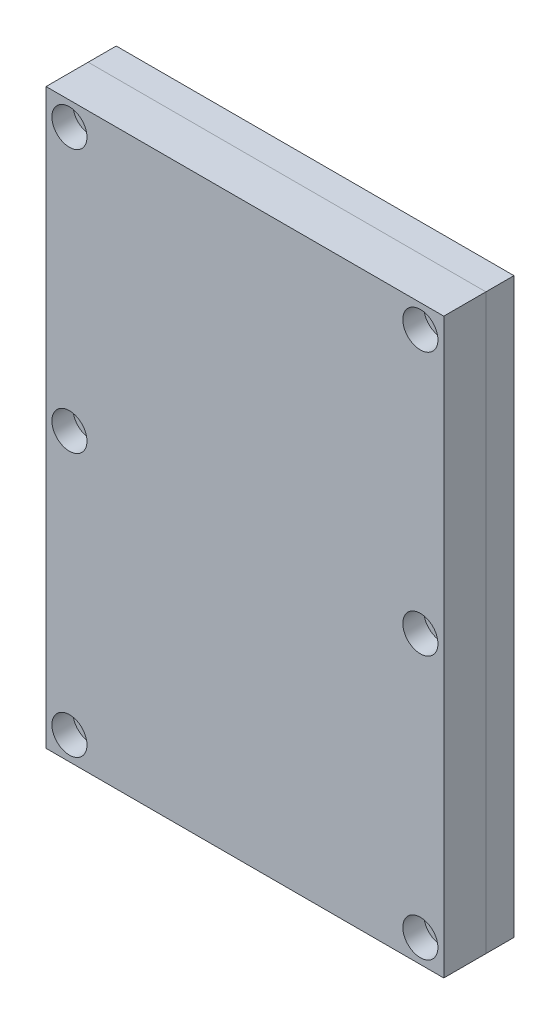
from build123d import *

# Parameters (mm, degrees)
CROQUIS1_W              = 170
CROQUIS1_H              = 245
SALIENTE_EXTRUIR1_DEPTH = 12
CROQUIS2_W              = 170
CROQUIS2_H              = 245
SALIENTE_EXTRUIR2_DEPTH = 18
CROQUIS3_R              = 4.5
CORTAR_EXTRUIR1_DEPTH   = 153.089611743
CROQUIS4_R              = 7.5
CORTAR_EXTRUIR2_DEPTH   = 9


with BuildPart() as part:
    # Croquis1 → Saliente-Extruir1 (new body)
    with BuildSketch(Plane.XY):
        Rectangle(CROQUIS1_W, CROQUIS1_H)
    extrude(amount=SALIENTE_EXTRUIR1_DEPTH)


with BuildPart() as body_2:
    # Croquis2 → Saliente-Extruir2 (new body)
    with BuildSketch(Plane.XY.offset(12)):
        Rectangle(CROQUIS2_W, CROQUIS2_H)
    extrude(amount=SALIENTE_EXTRUIR2_DEPTH)


with BuildPart() as cortar_extruir1_tool:
    # Croquis3 → Cortar-Extruir1 (new, through all)
    with BuildSketch(Plane.XY.offset(30)):
        with Locations((-75, 112.5)):
            Circle(CROQUIS3_R)
        with Locations((75, 112.5)):
            Circle(CROQUIS3_R)
        with Locations((-75, 0)):
            Circle(CROQUIS3_R)
        with Locations((75, 0)):
            Circle(CROQUIS3_R)
        with Locations((-75, -112.5)):
            Circle(CROQUIS3_R)
        with Locations((75, -112.5)):
            Circle(CROQUIS3_R)
    extrude(amount=-CORTAR_EXTRUIR1_DEPTH)


with BuildPart() as part_1:
    add(part.part)

    # Cortar-Extruir1: cut by cortar_extruir1_tool
    add(cortar_extruir1_tool.part, mode=Mode.SUBTRACT)


with BuildPart() as body_2_1:
    add(body_2.part)

    # Cortar-Extruir1: cut by cortar_extruir1_tool
    add(cortar_extruir1_tool.part, mode=Mode.SUBTRACT)

    # Croquis4 → Cortar-Extruir2 (cut)
    with BuildSketch(Plane.XY.offset(30)):
        with Locations((-75, 112.5)):
            Circle(CROQUIS4_R)
        with Locations((75, 112.5)):
            Circle(CROQUIS4_R)
        with Locations((75, 0)):
            Circle(CROQUIS4_R)
        with Locations((-75, 0)):
            Circle(CROQUIS4_R)
        with Locations((75, -112.5)):
            Circle(CROQUIS4_R)
        with Locations((-75, -112.5)):
            Circle(CROQUIS4_R)
    extrude(amount=-CORTAR_EXTRUIR2_DEPTH, mode=Mode.SUBTRACT)


solid = Compound([part_1.part, body_2_1.part])
